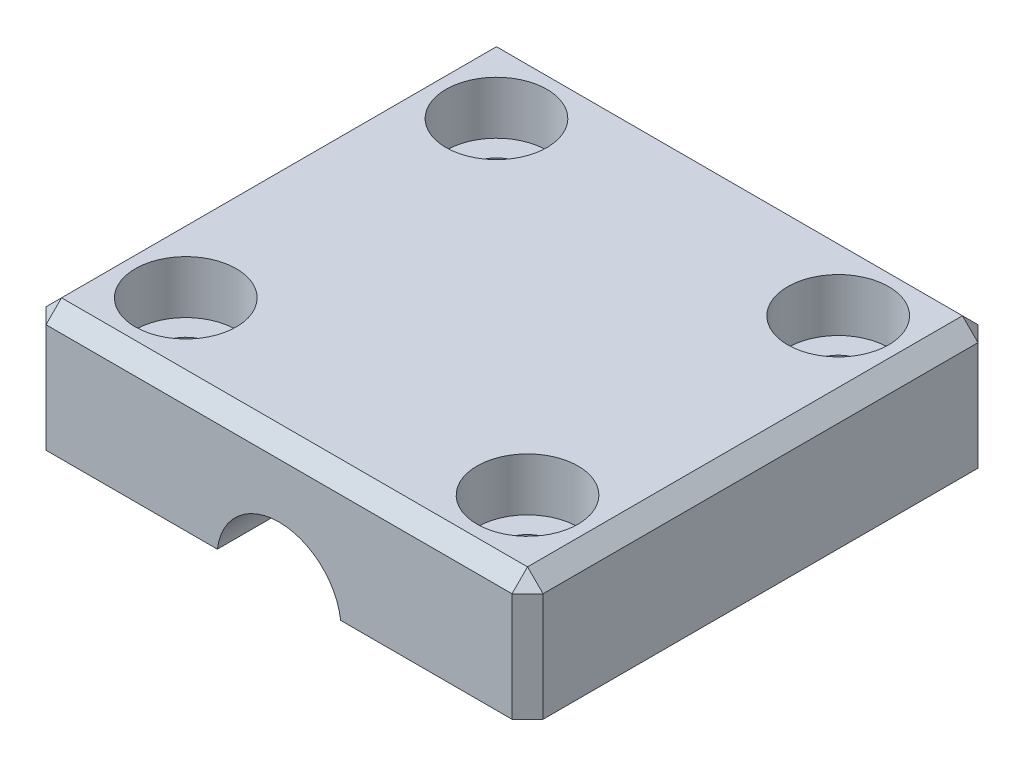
from build123d import *

# Parameters (mm, degrees)
SKIZZE1_W                                            = 32
SKIZZE1_H                                            = 30
AUFSATZ_LINEAR_AUSTRAGEN1_DEPTH                      = 8
STIRNSENKUNG_F_R_M3_ZYLINDERSCHRAUBE_MIT_D           = 3.4
STIRNSENKUNG_F_R_M3_ZYLINDERSCHRAUBE_MIT_CBORE_D     = 6.5
STIRNSENKUNG_F_R_M3_ZYLINDERSCHRAUBE_MIT_CBORE_DEPTH = 3.4
SKIZZE4_R                                            = 4
SCHNITT_LINEAR_AUSTRAGEN1_DEPTH                      = 35.928498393
FASE1_SIZE                                           = 1


with BuildPart() as part:
    # Skizze1 → Aufsatz-Linear austragen1 (new body)
    with BuildSketch(Plane(origin=(0, 0, 0), x_dir=(1, 0, 0), z_dir=(0, 1, 0))):
        Rectangle(SKIZZE1_W, SKIZZE1_H)
    extrude(amount=AUFSATZ_LINEAR_AUSTRAGEN1_DEPTH)

    # Stirnsenkung f_r M3 Zylinderschraube mit (through all)
    with Locations(Plane(origin=(0, 8, 0), x_dir=(1, 0, 0), z_dir=(0, 1, 0))):
        with Locations((-11, 10), (11, 10), (11, -10), (-11, -10)):
            CounterBoreHole(STIRNSENKUNG_F_R_M3_ZYLINDERSCHRAUBE_MIT_D / 2, STIRNSENKUNG_F_R_M3_ZYLINDERSCHRAUBE_MIT_CBORE_D / 2, STIRNSENKUNG_F_R_M3_ZYLINDERSCHRAUBE_MIT_CBORE_DEPTH)

    # Skizze4 → Schnitt-Linear austragen1 (cut, through all)
    with BuildSketch(Plane.XY.offset(15)):
        with Locations((0, -0.5)):
            Circle(SKIZZE4_R)
    extrude(amount=-SCHNITT_LINEAR_AUSTRAGEN1_DEPTH, mode=Mode.SUBTRACT)

    # Fase1
    fase1_edges = [part.edges().sort_by_distance(p)[0] for p in [
        (-16, 8, 0),
        (0, 8, 15),
        (16, 8, 0),
        (16, 4, 15),
        (-16, 4, 15),
        (-16, 4, -15),
        (16, 4, -15),
        (0, 8, -15),
    ]]
    chamfer(fase1_edges, length=FASE1_SIZE)


solid = part.part
